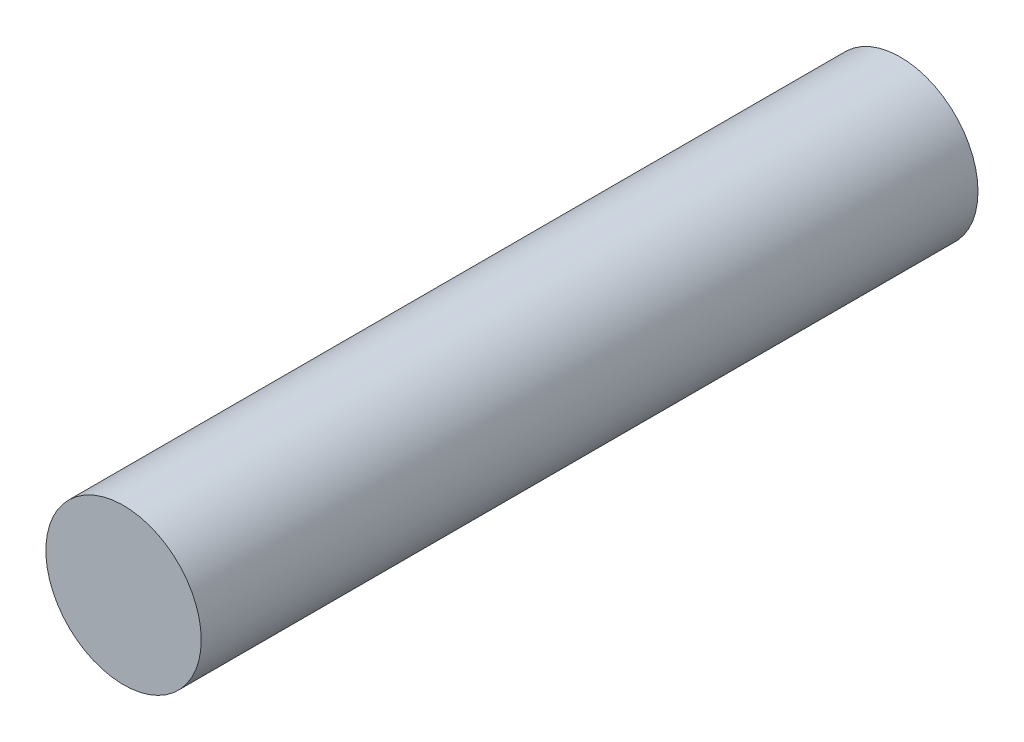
ISO-10303-21;
HEADER;
FILE_DESCRIPTION(('STEP AP214'),'2;1');
FILE_NAME('part.step','',(''),(''),'','','');
FILE_SCHEMA(('AUTOMOTIVE_DESIGN { 1 0 10303 214 1 1 1 1 }'));
ENDSEC;
DATA;
#1=APPLICATION_CONTEXT('core data for automotive mechanical design processes');
#2=APPLICATION_PROTOCOL_DEFINITION('international standard','automotive_design',2000,#1);
#3=PRODUCT_CONTEXT('',#1,'mechanical');
#4=PRODUCT('Part','Part','',(#3));
#5=PRODUCT_RELATED_PRODUCT_CATEGORY('part','',(#4));
#6=PRODUCT_DEFINITION_FORMATION('','',#4);
#7=PRODUCT_DEFINITION_CONTEXT('part definition',#1,'design');
#8=PRODUCT_DEFINITION('design','',#6,#7);
#9=PRODUCT_DEFINITION_SHAPE('','',#8);
#10=(LENGTH_UNIT() NAMED_UNIT(*) SI_UNIT(.MILLI.,.METRE.));
#11=(NAMED_UNIT(*) PLANE_ANGLE_UNIT() SI_UNIT($,.RADIAN.));
#12=(NAMED_UNIT(*) SI_UNIT($,.STERADIAN.) SOLID_ANGLE_UNIT());
#13=UNCERTAINTY_MEASURE_WITH_UNIT(LENGTH_MEASURE(1.E-05),#10,'distance_accuracy_value','');
#14=(GEOMETRIC_REPRESENTATION_CONTEXT(3) GLOBAL_UNCERTAINTY_ASSIGNED_CONTEXT((#13)) GLOBAL_UNIT_ASSIGNED_CONTEXT((#10,
#11,#12)) REPRESENTATION_CONTEXT('',''));
#15=CARTESIAN_POINT('',(0.,0.,0.));
#16=DIRECTION('',(0.,0.,1.));
#17=DIRECTION('',(1.,0.,0.));
#18=AXIS2_PLACEMENT_3D('',#15,#16,#17);
#19=CARTESIAN_POINT('',(0.,42.,60.));
#20=DIRECTION('',(0.,0.,-1.));
#21=DIRECTION('',(-1.,0.,0.));
#22=AXIS2_PLACEMENT_3D('',#19,#20,#21);
#23=CYLINDRICAL_SURFACE('',#22,6.);
#24=CARTESIAN_POINT('',(0.,42.,60.));
#25=DIRECTION('',(0.,0.,1.));
#26=DIRECTION('',(1.,0.,0.));
#27=AXIS2_PLACEMENT_3D('',#24,#25,#26);
#28=CIRCLE('',#27,6.);
#29=CARTESIAN_POINT('',(6.,42.,60.));
#30=VERTEX_POINT('',#29);
#31=EDGE_CURVE('E10',#30,#30,#28,.T.);
#32=ORIENTED_EDGE('',*,*,#31,.F.);
#33=EDGE_LOOP('',(#32));
#34=FACE_BOUND('',#33,.T.);
#35=CARTESIAN_POINT('',(0.,42.,0.));
#36=DIRECTION('',(0.,0.,1.));
#37=DIRECTION('',(1.,0.,0.));
#38=AXIS2_PLACEMENT_3D('',#35,#36,#37);
#39=CIRCLE('',#38,6.);
#40=CARTESIAN_POINT('',(6.,42.,0.));
#41=VERTEX_POINT('',#40);
#42=EDGE_CURVE('E17',#41,#41,#39,.T.);
#43=ORIENTED_EDGE('',*,*,#42,.T.);
#44=EDGE_LOOP('',(#43));
#45=FACE_BOUND('',#44,.T.);
#46=ADVANCED_FACE('F14',(#34,#45),#23,.T.);
#47=CARTESIAN_POINT('',(0.,42.,60.));
#48=DIRECTION('',(0.,0.,1.));
#49=DIRECTION('',(1.,0.,0.));
#50=AXIS2_PLACEMENT_3D('',#47,#48,#49);
#51=PLANE('',#50);
#52=ORIENTED_EDGE('',*,*,#31,.T.);
#53=EDGE_LOOP('',(#52));
#54=FACE_BOUND('',#53,.T.);
#55=ADVANCED_FACE('F29',(#54),#51,.T.);
#56=CARTESIAN_POINT('',(0.,42.,0.));
#57=DIRECTION('',(0.,0.,1.));
#58=DIRECTION('',(1.,0.,0.));
#59=AXIS2_PLACEMENT_3D('',#56,#57,#58);
#60=PLANE('',#59);
#61=ORIENTED_EDGE('',*,*,#42,.F.);
#62=EDGE_LOOP('',(#61));
#63=FACE_BOUND('',#62,.T.);
#64=ADVANCED_FACE('F27',(#63),#60,.F.);
#65=CLOSED_SHELL('',(#46,#55,#64));
#66=MANIFOLD_SOLID_BREP('B1',#65);
#67=ADVANCED_BREP_SHAPE_REPRESENTATION('',(#18,#66),#14);
#68=SHAPE_DEFINITION_REPRESENTATION(#9,#67);
ENDSEC;
END-ISO-10303-21;
